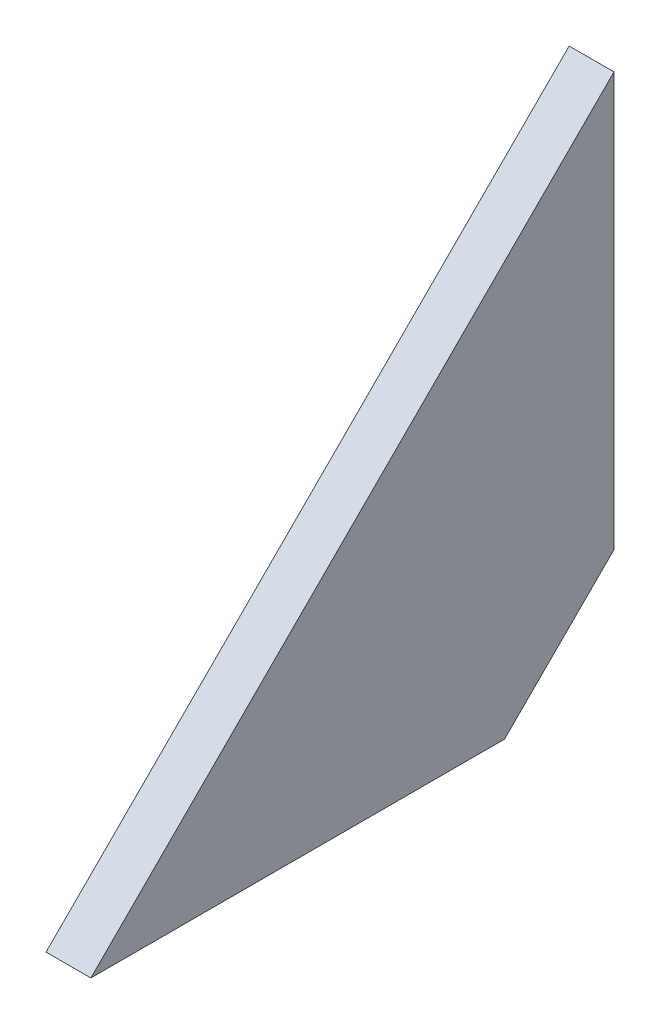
from build123d import *

# Parameters (mm, degrees)
BASE_EXTRUSION_DEPTH = 6


with BuildPart() as part:
    # Esquisse1 → Base-Extrusion (new body)
    with BuildSketch(Plane(origin=(0, 0, 0), x_dir=(0, 0, -1), z_dir=(1, 0, 0))):
        Polygon((0, 14.644660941), (0, 70), (-70, 0), (-14.644660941, 0), align=None)
    extrude(amount=-BASE_EXTRUSION_DEPTH)


solid = part.part
